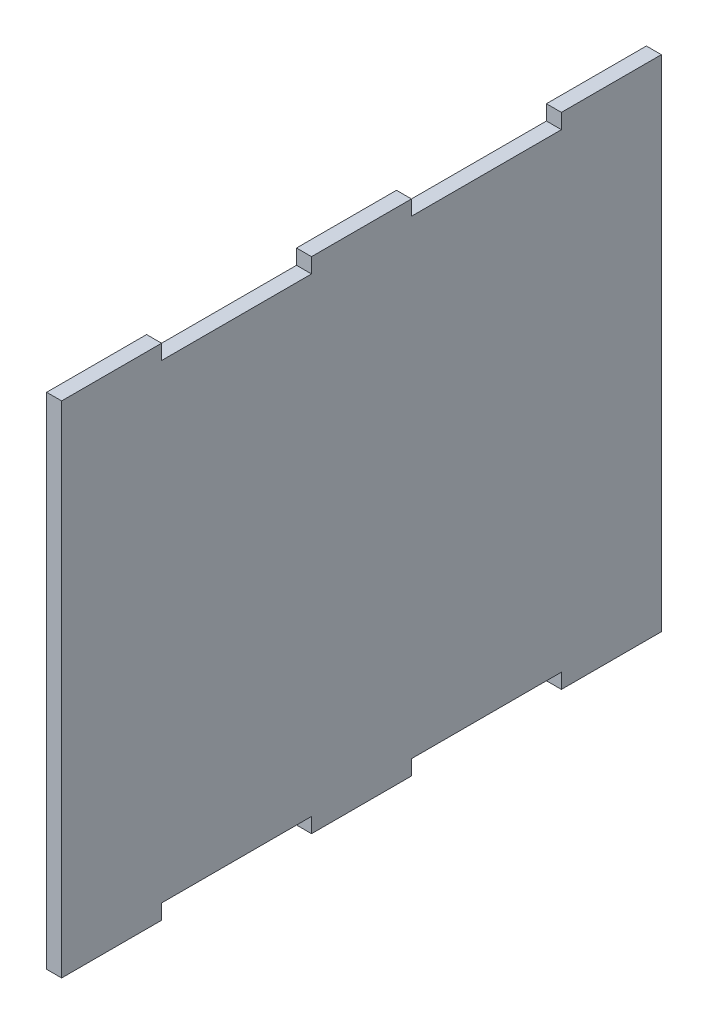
from build123d import *

# Parameters (mm, degrees)
SKETCH_1_W      = 120
SKETCH_1_H      = 94
EXTRUDE_1_DEPTH = 3
SKETCH_2_W      = 20
SKETCH_2_H      = 3
EXTRUDE_2_DEPTH = 3


with BuildPart() as part:
    # Sketch 1 → Extrude 1 (new body)
    with BuildSketch(Plane(origin=(0, 0, 0), x_dir=(0, 0, -1), z_dir=(1, 0, 0))):
        with Locations((-4.464783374, -20.026261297)):
            Rectangle(SKETCH_1_W, SKETCH_1_H)
    extrude(amount=EXTRUDE_1_DEPTH)

    # Sketch 2 → Extrude 2 (add)
    with BuildSketch(Plane(origin=(3, 0, 0), x_dir=(0, 0, -1), z_dir=(1, 0, 0))):
        with Locations((-54.464783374, -68.526261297)):
            Rectangle(SKETCH_2_W, SKETCH_2_H)
        with Locations((-4.464783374, -68.526261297)):
            Rectangle(SKETCH_2_W, SKETCH_2_H)
        with Locations((45.535216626, -68.526261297)):
            Rectangle(SKETCH_2_W, SKETCH_2_H)
        with Locations((45.535216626, 28.473738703)):
            Rectangle(SKETCH_2_W, SKETCH_2_H)
        with Locations((-4.464783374, 28.473738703)):
            Rectangle(SKETCH_2_W, SKETCH_2_H)
        with Locations((-54.464783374, 28.473738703)):
            Rectangle(SKETCH_2_W, SKETCH_2_H)
    extrude(amount=-EXTRUDE_2_DEPTH)


solid = part.part
